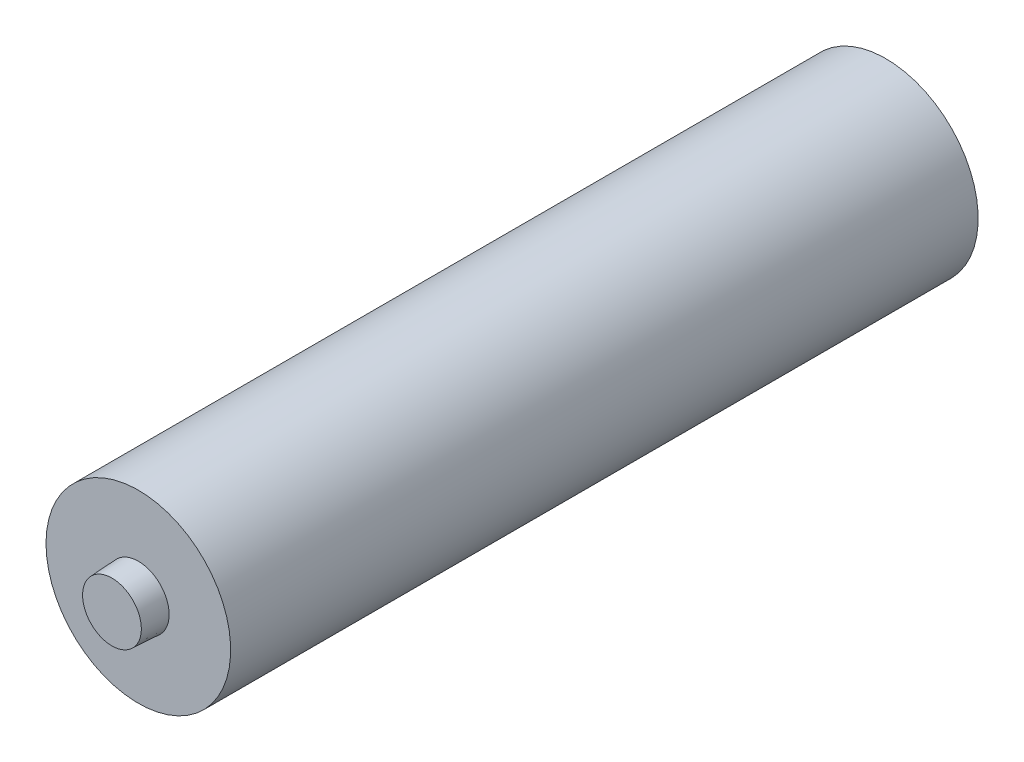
ISO-10303-21;
HEADER;
FILE_DESCRIPTION(('STEP AP214'),'2;1');
FILE_NAME('part.step','',(''),(''),'','','');
FILE_SCHEMA(('AUTOMOTIVE_DESIGN { 1 0 10303 214 1 1 1 1 }'));
ENDSEC;
DATA;
#1=APPLICATION_CONTEXT('core data for automotive mechanical design processes');
#2=APPLICATION_PROTOCOL_DEFINITION('international standard','automotive_design',2000,#1);
#3=PRODUCT_CONTEXT('',#1,'mechanical');
#4=PRODUCT('Part','Part','',(#3));
#5=PRODUCT_RELATED_PRODUCT_CATEGORY('part','',(#4));
#6=PRODUCT_DEFINITION_FORMATION('','',#4);
#7=PRODUCT_DEFINITION_CONTEXT('part definition',#1,'design');
#8=PRODUCT_DEFINITION('design','',#6,#7);
#9=PRODUCT_DEFINITION_SHAPE('','',#8);
#10=(LENGTH_UNIT() NAMED_UNIT(*) SI_UNIT(.MILLI.,.METRE.));
#11=(NAMED_UNIT(*) PLANE_ANGLE_UNIT() SI_UNIT($,.RADIAN.));
#12=(NAMED_UNIT(*) SI_UNIT($,.STERADIAN.) SOLID_ANGLE_UNIT());
#13=UNCERTAINTY_MEASURE_WITH_UNIT(LENGTH_MEASURE(1.E-05),#10,'distance_accuracy_value','');
#14=(GEOMETRIC_REPRESENTATION_CONTEXT(3) GLOBAL_UNCERTAINTY_ASSIGNED_CONTEXT((#13)) GLOBAL_UNIT_ASSIGNED_CONTEXT((#10,
#11,#12)) REPRESENTATION_CONTEXT('',''));
#15=CARTESIAN_POINT('',(0.,0.,0.));
#16=DIRECTION('',(0.,0.,1.));
#17=DIRECTION('',(1.,0.,0.));
#18=AXIS2_PLACEMENT_3D('',#15,#16,#17);
#19=CARTESIAN_POINT('',(0.,0.,42.5));
#20=DIRECTION('',(0.,0.,0.999999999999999));
#21=DIRECTION('',(1.,0.,0.));
#22=AXIS2_PLACEMENT_3D('',#19,#20,#21);
#23=PLANE('',#22);
#24=CARTESIAN_POINT('',(0.,0.,42.5));
#25=DIRECTION('',(0.,0.,0.999999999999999));
#26=DIRECTION('',(1.,0.,0.));
#27=AXIS2_PLACEMENT_3D('',#24,#25,#26);
#28=CIRCLE('',#27,5.25);
#29=CARTESIAN_POINT('',(-5.25,0.,42.5));
#30=VERTEX_POINT('',#29);
#31=EDGE_CURVE('E10',#30,#30,#28,.T.);
#32=ORIENTED_EDGE('',*,*,#31,.T.);
#33=EDGE_LOOP('',(#32));
#34=FACE_BOUND('',#33,.T.);
#35=CARTESIAN_POINT('',(0.,0.,42.5));
#36=DIRECTION('',(0.,0.,0.999999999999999));
#37=DIRECTION('',(1.,0.,0.));
#38=AXIS2_PLACEMENT_3D('',#35,#36,#37);
#39=CIRCLE('',#38,1.75);
#40=CARTESIAN_POINT('',(1.75,0.,42.5));
#41=VERTEX_POINT('',#40);
#42=EDGE_CURVE('E40',#41,#41,#39,.T.);
#43=ORIENTED_EDGE('',*,*,#42,.F.);
#44=EDGE_LOOP('',(#43));
#45=FACE_BOUND('',#44,.T.);
#46=ADVANCED_FACE('F25',(#34,#45),#23,.T.);
#47=CARTESIAN_POINT('',(0.,0.,42.5));
#48=DIRECTION('',(0.,0.,-0.999999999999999));
#49=DIRECTION('',(-1.,0.,0.));
#50=AXIS2_PLACEMENT_3D('',#47,#48,#49);
#51=CYLINDRICAL_SURFACE('',#50,5.25);
#52=CARTESIAN_POINT('',(0.,0.,0.));
#53=DIRECTION('',(0.,0.,0.999999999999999));
#54=DIRECTION('',(1.,0.,0.));
#55=AXIS2_PLACEMENT_3D('',#52,#53,#54);
#56=CIRCLE('',#55,5.25);
#57=CARTESIAN_POINT('',(-5.25,0.,0.));
#58=VERTEX_POINT('',#57);
#59=EDGE_CURVE('E32',#58,#58,#56,.T.);
#60=CARTESIAN_POINT('',(-5.25,0.,42.5));
#61=CARTESIAN_POINT('',(-5.25,0.,42.0572916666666));
#62=CARTESIAN_POINT('',(-5.25,0.,41.6145833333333));
#63=CARTESIAN_POINT('',(-5.25,0.,40.7291666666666));
#64=CARTESIAN_POINT('',(-5.25,0.,40.2864583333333));
#65=CARTESIAN_POINT('',(-5.25,0.,39.4010416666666));
#66=CARTESIAN_POINT('',(-5.25,0.,38.9583333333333));
#67=CARTESIAN_POINT('',(-5.25,0.,38.0729166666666));
#68=CARTESIAN_POINT('',(-5.25,0.,37.6302083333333));
#69=CARTESIAN_POINT('',(-5.25,0.,36.7447916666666));
#70=CARTESIAN_POINT('',(-5.25,0.,36.3020833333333));
#71=CARTESIAN_POINT('',(-5.25,0.,35.4166666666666));
#72=CARTESIAN_POINT('',(-5.25,0.,34.9739583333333));
#73=CARTESIAN_POINT('',(-5.25,0.,34.0885416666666));
#74=CARTESIAN_POINT('',(-5.25,0.,33.6458333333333));
#75=CARTESIAN_POINT('',(-5.25,0.,32.7604166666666));
#76=CARTESIAN_POINT('',(-5.25,0.,32.3177083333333));
#77=CARTESIAN_POINT('',(-5.25,0.,31.4322916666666));
#78=CARTESIAN_POINT('',(-5.25,0.,30.9895833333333));
#79=CARTESIAN_POINT('',(-5.25,0.,30.1041666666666));
#80=CARTESIAN_POINT('',(-5.25,0.,29.6614583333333));
#81=CARTESIAN_POINT('',(-5.25,0.,28.7760416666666));
#82=CARTESIAN_POINT('',(-5.25,0.,28.3333333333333));
#83=CARTESIAN_POINT('',(-5.25,0.,27.4479166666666));
#84=CARTESIAN_POINT('',(-5.25,0.,27.0052083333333));
#85=CARTESIAN_POINT('',(-5.25,0.,26.1197916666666));
#86=CARTESIAN_POINT('',(-5.25,0.,25.6770833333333));
#87=CARTESIAN_POINT('',(-5.25,0.,24.7916666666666));
#88=CARTESIAN_POINT('',(-5.25,0.,24.3489583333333));
#89=CARTESIAN_POINT('',(-5.25,0.,23.4635416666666));
#90=CARTESIAN_POINT('',(-5.25,0.,23.0208333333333));
#91=CARTESIAN_POINT('',(-5.25,0.,22.1354166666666));
#92=CARTESIAN_POINT('',(-5.25,0.,21.6927083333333));
#93=CARTESIAN_POINT('',(-5.25,0.,20.8072916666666));
#94=CARTESIAN_POINT('',(-5.25,0.,20.3645833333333));
#95=CARTESIAN_POINT('',(-5.25,0.,19.4791666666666));
#96=CARTESIAN_POINT('',(-5.25,0.,19.0364583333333));
#97=CARTESIAN_POINT('',(-5.25,0.,18.1510416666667));
#98=CARTESIAN_POINT('',(-5.25,0.,17.7083333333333));
#99=CARTESIAN_POINT('',(-5.25,0.,16.8229166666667));
#100=CARTESIAN_POINT('',(-5.25,0.,16.3802083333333));
#101=CARTESIAN_POINT('',(-5.25,0.,15.4947916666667));
#102=CARTESIAN_POINT('',(-5.25,0.,15.0520833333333));
#103=CARTESIAN_POINT('',(-5.25,0.,14.1666666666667));
#104=CARTESIAN_POINT('',(-5.25,0.,13.7239583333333));
#105=CARTESIAN_POINT('',(-5.25,0.,12.8385416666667));
#106=CARTESIAN_POINT('',(-5.25,0.,12.3958333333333));
#107=CARTESIAN_POINT('',(-5.25,0.,11.5104166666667));
#108=CARTESIAN_POINT('',(-5.25,0.,11.0677083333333));
#109=CARTESIAN_POINT('',(-5.25,0.,10.1822916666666));
#110=CARTESIAN_POINT('',(-5.25,0.,9.73958333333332));
#111=CARTESIAN_POINT('',(-5.25,0.,8.85416666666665));
#112=CARTESIAN_POINT('',(-5.25,0.,8.41145833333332));
#113=CARTESIAN_POINT('',(-5.25,0.,7.52604166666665));
#114=CARTESIAN_POINT('',(-5.25,0.,7.08333333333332));
#115=CARTESIAN_POINT('',(-5.25,0.,6.19791666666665));
#116=CARTESIAN_POINT('',(-5.25,0.,5.75520833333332));
#117=CARTESIAN_POINT('',(-5.25,0.,4.86979166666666));
#118=CARTESIAN_POINT('',(-5.25,0.,4.42708333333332));
#119=CARTESIAN_POINT('',(-5.25,0.,3.54166666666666));
#120=CARTESIAN_POINT('',(-5.25,0.,3.09895833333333));
#121=CARTESIAN_POINT('',(-5.25,0.,2.21354166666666));
#122=CARTESIAN_POINT('',(-5.25,0.,1.77083333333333));
#123=CARTESIAN_POINT('',(-5.25,0.,0.885416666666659));
#124=CARTESIAN_POINT('',(-5.25,0.,0.442708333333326));
#125=CARTESIAN_POINT('',(-5.25,0.,0.));
#126=B_SPLINE_CURVE_WITH_KNOTS('',3,(#60,#61,#62,#63,#64,#65,#66,#67,#68,#69,#70,#71,#72,#73,
#74,#75,#76,#77,#78,#79,#80,#81,#82,#83,#84,#85,#86,#87,#88,#89,#90,#91,#92,#93,#94,#95,#96,#97,
#98,#99,#100,#101,#102,#103,#104,#105,#106,#107,#108,#109,#110,#111,#112,#113,#114,#115,#116,
#117,#118,#119,#120,#121,#122,#123,#124,#125),.UNSPECIFIED.,.F.,.F.,(4,2,2,2,2,2,2,2,2,2,2,2,2,
2,2,2,2,2,2,2,2,2,2,2,2,2,2,2,2,2,2,2,4),(0.,1.32812499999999,2.65624999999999,3.98437499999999,
5.31249999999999,6.64062499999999,7.96874999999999,9.29687499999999,10.625,11.953125,13.28125,
14.609375,15.9375,17.265625,18.59375,19.921875,21.25,22.578125,23.90625,25.234375,26.5625,
27.890625,29.21875,30.546875,31.875,33.203125,34.53125,35.859375,37.1875,38.515625,39.84375,
41.171875,42.5),.UNSPECIFIED.);
#127=EDGE_CURVE('BSEAM27',#30,#58,#126,.T.);
#128=ORIENTED_EDGE('',*,*,#31,.F.);
#129=ORIENTED_EDGE('',*,*,#59,.T.);
#130=ORIENTED_EDGE('',*,*,#127,.T.);
#131=ORIENTED_EDGE('',*,*,#127,.F.);
#132=EDGE_LOOP('',(#128,#130,#129,#131));
#133=FACE_BOUND('',#132,.T.);
#134=ADVANCED_FACE('F27',(#133),#51,.T.);
#135=CARTESIAN_POINT('',(0.,0.,0.));
#136=DIRECTION('',(0.,0.,0.999999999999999));
#137=DIRECTION('',(1.,0.,0.));
#138=AXIS2_PLACEMENT_3D('',#135,#136,#137);
#139=PLANE('',#138);
#140=ORIENTED_EDGE('',*,*,#59,.F.);
#141=EDGE_LOOP('',(#140));
#142=FACE_BOUND('',#141,.T.);
#143=ADVANCED_FACE('F52',(#142),#139,.F.);
#144=CARTESIAN_POINT('',(0.,0.,42.5));
#145=DIRECTION('',(0.,0.,-0.999999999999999));
#146=DIRECTION('',(1.,0.,0.));
#147=AXIS2_PLACEMENT_3D('',#144,#145,#146);
#148=CONICAL_SURFACE('',#147,1.75,0.05235987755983);
#149=CARTESIAN_POINT('',(0.,0.,44.));
#150=DIRECTION('',(0.,0.,0.999999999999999));
#151=DIRECTION('',(1.,0.,0.));
#152=AXIS2_PLACEMENT_3D('',#149,#150,#151);
#153=CIRCLE('',#152,1.67138833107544);
#154=CARTESIAN_POINT('',(1.67138833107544,0.,44.));
#155=VERTEX_POINT('',#154);
#156=EDGE_CURVE('E36',#155,#155,#153,.T.);
#157=CARTESIAN_POINT('',(1.67138833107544,0.,44.));
#158=CARTESIAN_POINT('',(1.67220720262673,0.,43.984375));
#159=CARTESIAN_POINT('',(1.67302607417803,0.,43.96875));
#160=CARTESIAN_POINT('',(1.67466381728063,0.,43.9375));
#161=CARTESIAN_POINT('',(1.67548268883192,0.,43.921875));
#162=CARTESIAN_POINT('',(1.67712043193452,0.,43.890625));
#163=CARTESIAN_POINT('',(1.67793930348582,0.,43.875));
#164=CARTESIAN_POINT('',(1.67957704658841,0.,43.84375));
#165=CARTESIAN_POINT('',(1.68039591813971,0.,43.828125));
#166=CARTESIAN_POINT('',(1.68203366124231,0.,43.796875));
#167=CARTESIAN_POINT('',(1.6828525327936,0.,43.78125));
#168=CARTESIAN_POINT('',(1.6844902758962,0.,43.75));
#169=CARTESIAN_POINT('',(1.6853091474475,0.,43.734375));
#170=CARTESIAN_POINT('',(1.68694689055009,0.,43.703125));
#171=CARTESIAN_POINT('',(1.68776576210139,0.,43.6875));
#172=CARTESIAN_POINT('',(1.68940350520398,0.,43.65625));
#173=CARTESIAN_POINT('',(1.69022237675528,0.,43.640625));
#174=CARTESIAN_POINT('',(1.69186011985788,0.,43.609375));
#175=CARTESIAN_POINT('',(1.69267899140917,0.,43.59375));
#176=CARTESIAN_POINT('',(1.69431673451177,0.,43.5625));
#177=CARTESIAN_POINT('',(1.69513560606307,0.,43.546875));
#178=CARTESIAN_POINT('',(1.69677334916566,0.,43.515625));
#179=CARTESIAN_POINT('',(1.69759222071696,0.,43.5));
#180=CARTESIAN_POINT('',(1.69922996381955,0.,43.46875));
#181=CARTESIAN_POINT('',(1.70004883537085,0.,43.453125));
#182=CARTESIAN_POINT('',(1.70168657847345,0.,43.421875));
#183=CARTESIAN_POINT('',(1.70250545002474,0.,43.40625));
#184=CARTESIAN_POINT('',(1.70414319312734,0.,43.375));
#185=CARTESIAN_POINT('',(1.70496206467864,0.,43.359375));
#186=CARTESIAN_POINT('',(1.70659980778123,0.,43.328125));
#187=CARTESIAN_POINT('',(1.70741867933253,0.,43.3125));
#188=CARTESIAN_POINT('',(1.70905642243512,0.,43.28125));
#189=CARTESIAN_POINT('',(1.70987529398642,0.,43.265625));
#190=CARTESIAN_POINT('',(1.71151303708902,0.,43.234375));
#191=CARTESIAN_POINT('',(1.71233190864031,0.,43.21875));
#192=CARTESIAN_POINT('',(1.71396965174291,0.,43.1875));
#193=CARTESIAN_POINT('',(1.71478852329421,0.,43.171875));
#194=CARTESIAN_POINT('',(1.7164262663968,0.,43.140625));
#195=CARTESIAN_POINT('',(1.7172451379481,0.,43.125));
#196=CARTESIAN_POINT('',(1.71888288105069,0.,43.09375));
#197=CARTESIAN_POINT('',(1.71970175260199,0.,43.078125));
#198=CARTESIAN_POINT('',(1.72133949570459,0.,43.046875));
#199=CARTESIAN_POINT('',(1.72215836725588,0.,43.03125));
#200=CARTESIAN_POINT('',(1.72379611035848,0.,43.));
#201=CARTESIAN_POINT('',(1.72461498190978,0.,42.984375));
#202=CARTESIAN_POINT('',(1.72625272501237,0.,42.953125));
#203=CARTESIAN_POINT('',(1.72707159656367,0.,42.9375));
#204=CARTESIAN_POINT('',(1.72870933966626,0.,42.90625));
#205=CARTESIAN_POINT('',(1.72952821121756,0.,42.890625));
#206=CARTESIAN_POINT('',(1.73116595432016,0.,42.859375));
#207=CARTESIAN_POINT('',(1.73198482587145,0.,42.84375));
#208=CARTESIAN_POINT('',(1.73362256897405,0.,42.8125));
#209=CARTESIAN_POINT('',(1.73444144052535,0.,42.796875));
#210=CARTESIAN_POINT('',(1.73607918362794,0.,42.765625));
#211=CARTESIAN_POINT('',(1.73689805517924,0.,42.75));
#212=CARTESIAN_POINT('',(1.73853579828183,0.,42.71875));
#213=CARTESIAN_POINT('',(1.73935466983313,0.,42.703125));
#214=CARTESIAN_POINT('',(1.74099241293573,0.,42.671875));
#215=CARTESIAN_POINT('',(1.74181128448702,0.,42.65625));
#216=CARTESIAN_POINT('',(1.74344902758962,0.,42.625));
#217=CARTESIAN_POINT('',(1.74426789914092,0.,42.609375));
#218=CARTESIAN_POINT('',(1.74590564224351,0.,42.578125));
#219=CARTESIAN_POINT('',(1.74672451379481,0.,42.5625));
#220=CARTESIAN_POINT('',(1.7483622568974,0.,42.53125));
#221=CARTESIAN_POINT('',(1.7491811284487,0.,42.515625));
#222=CARTESIAN_POINT('',(1.75,0.,42.5));
#223=B_SPLINE_CURVE_WITH_KNOTS('',3,(#157,#158,#159,#160,#161,#162,#163,#164,#165,#166,#167,
#168,#169,#170,#171,#172,#173,#174,#175,#176,#177,#178,#179,#180,#181,#182,#183,#184,#185,#186,
#187,#188,#189,#190,#191,#192,#193,#194,#195,#196,#197,#198,#199,#200,#201,#202,#203,#204,#205,
#206,#207,#208,#209,#210,#211,#212,#213,#214,#215,#216,#217,#218,#219,#220,#221,#222),
.UNSPECIFIED.,.F.,.F.,(4,2,2,2,2,2,2,2,2,2,2,2,2,2,2,2,2,2,2,2,2,2,2,2,2,2,2,2,2,2,2,2,4),(0.,
0.0469393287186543,0.0938786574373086,0.140817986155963,0.18775731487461,0.234696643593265,
0.281635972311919,0.328575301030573,0.375514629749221,0.422453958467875,0.469393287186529,
0.516332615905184,0.563271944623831,0.610211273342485,0.65715060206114,0.704089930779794,
0.751029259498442,0.797968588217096,0.84490791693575,0.891847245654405,0.938786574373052,
0.985725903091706,1.03266523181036,1.07960456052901,1.12654388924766,1.17348321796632,
1.22042254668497,1.26736187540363,1.31430120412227,1.36124053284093,1.40817986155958,
1.45511919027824,1.50205851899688),.UNSPECIFIED.);
#224=EDGE_CURVE('BSEAM46',#155,#41,#223,.T.);
#225=ORIENTED_EDGE('',*,*,#156,.F.);
#226=ORIENTED_EDGE('',*,*,#42,.T.);
#227=ORIENTED_EDGE('',*,*,#224,.T.);
#228=ORIENTED_EDGE('',*,*,#224,.F.);
#229=EDGE_LOOP('',(#225,#227,#226,#228));
#230=FACE_BOUND('',#229,.T.);
#231=ADVANCED_FACE('F46',(#230),#148,.T.);
#232=CARTESIAN_POINT('',(0.,0.,44.));
#233=DIRECTION('',(0.,0.,0.999999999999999));
#234=DIRECTION('',(1.,0.,0.));
#235=AXIS2_PLACEMENT_3D('',#232,#233,#234);
#236=PLANE('',#235);
#237=ORIENTED_EDGE('',*,*,#156,.T.);
#238=EDGE_LOOP('',(#237));
#239=FACE_BOUND('',#238,.T.);
#240=ADVANCED_FACE('F60',(#239),#236,.T.);
#241=CLOSED_SHELL('',(#46,#134,#143,#231,#240));
#242=MANIFOLD_SOLID_BREP('B2',#241);
#243=ADVANCED_BREP_SHAPE_REPRESENTATION('',(#18,#242),#14);
#244=SHAPE_DEFINITION_REPRESENTATION(#9,#243);
ENDSEC;
END-ISO-10303-21;
